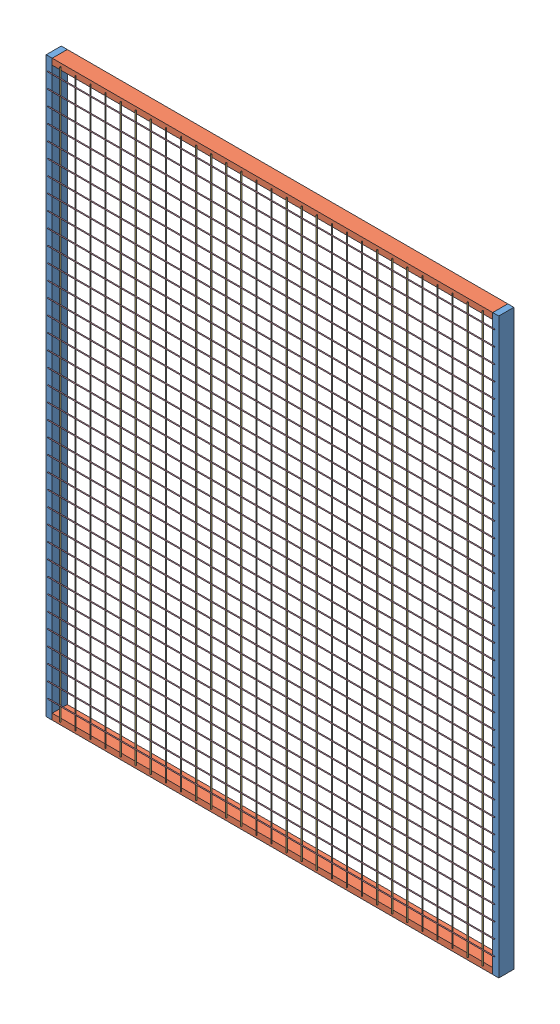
SolidWorks assembly 14E161 grilles protection 1900x1500.SLDASM, configuration Défaut (file format 10000). Lengths in mm.
Overall size (1500 1900 55.88).
70 component instances, 4 part files, 16 mates.
Components (placement in the parent):
- 14E026 profilé grillage 1900x50x20-1: 14E026 profilé grillage 1900x50x20.SLDPRT [Défaut] at (-634.6308 -991.4794 25) size (20 1900 50)
- 14E029 profilé grillage 1460x50x20-1: 14E029 profilé grillage 1460x50x20.SLDPRT [Défaut] at (-634.6308 888.5206 25) x (0 1 0) z (0 0 1) size (20 1460 50)
- 14E029 profilé grillage 1460x50x20-2: 14E029 profilé grillage 1460x50x20.SLDPRT [Défaut] at (-2094.6308 -971.4794 25) x (0 -1 0) z (0 0 1) size (20 1460 50)
- 14E026 profilé grillage 1900x50x20-2: 14E026 profilé grillage 1900x50x20.SLDPRT [Défaut] at (-2114.6308 -991.4794 25) size (20 1900 50)
- 14E031 fils vertical grille 1860 diam 3-51: 14E031 fils vertical grille 1860 diam 3.SLDPRT [Défaut] at (-2066.1308 -981.4794 26.5) x (-0.972525 0 0.232799) z (-0.232799 0 -0.972525) size (3 1880 3)
- 14E031 fils vertical grille 1860 diam 3-52: 14E031 fils vertical grille 1860 diam 3.SLDPRT [Défaut] at (-2016.1308 -981.4794 26.5) x (-0.972525 0 0.232799) z (-0.232799 0 -0.972525) size (3 1880 3)
- 14E031 fils vertical grille 1860 diam 3-53: 14E031 fils vertical grille 1860 diam 3.SLDPRT [Défaut] at (-1966.1308 -981.4794 26.5) x (-0.972525 0 0.232799) z (-0.232799 0 -0.972525) size (3 1880 3)
- 14E031 fils vertical grille 1860 diam 3-54: 14E031 fils vertical grille 1860 diam 3.SLDPRT [Défaut] at (-1916.1308 -981.4794 26.5) x (-0.972525 0 0.232799) z (-0.232799 0 -0.972525) size (3 1880 3)
- 14E031 fils vertical grille 1860 diam 3-55: 14E031 fils vertical grille 1860 diam 3.SLDPRT [Défaut] at (-1866.1308 -981.4794 26.5) x (-0.972525 0 0.232799) z (-0.232799 0 -0.972525) size (3 1880 3)
- 14E031 fils vertical grille 1860 diam 3-56: 14E031 fils vertical grille 1860 diam 3.SLDPRT [Défaut] at (-1816.1308 -981.4794 26.5) x (-0.972525 0 0.232799) z (-0.232799 0 -0.972525) size (3 1880 3)
- 14E031 fils vertical grille 1860 diam 3-57: 14E031 fils vertical grille 1860 diam 3.SLDPRT [Défaut] at (-1766.1308 -981.4794 26.5) x (-0.972525 0 0.232799) z (-0.232799 0 -0.972525) size (3 1880 3)
- 14E031 fils vertical grille 1860 diam 3-58: 14E031 fils vertical grille 1860 diam 3.SLDPRT [Défaut] at (-1716.1308 -981.4794 26.5) x (-0.972525 0 0.232799) z (-0.232799 0 -0.972525) size (3 1880 3)
- 14E031 fils vertical grille 1860 diam 3-59: 14E031 fils vertical grille 1860 diam 3.SLDPRT [Défaut] at (-1666.1308 -981.4794 26.5) x (-0.972525 0 0.232799) z (-0.232799 0 -0.972525) size (3 1880 3)
- 14E031 fils vertical grille 1860 diam 3-60: 14E031 fils vertical grille 1860 diam 3.SLDPRT [Défaut] at (-1616.1308 -981.4794 26.5) x (-0.972525 0 0.232799) z (-0.232799 0 -0.972525) size (3 1880 3)
- 14E031 fils vertical grille 1860 diam 3-61: 14E031 fils vertical grille 1860 diam 3.SLDPRT [Défaut] at (-1566.1308 -981.4794 26.5) x (-0.972525 0 0.232799) z (-0.232799 0 -0.972525) size (3 1880 3)
- 14E031 fils vertical grille 1860 diam 3-62: 14E031 fils vertical grille 1860 diam 3.SLDPRT [Défaut] at (-1516.1308 -981.4794 26.5) x (-0.972525 0 0.232799) z (-0.232799 0 -0.972525) size (3 1880 3)
- 14E031 fils vertical grille 1860 diam 3-63: 14E031 fils vertical grille 1860 diam 3.SLDPRT [Défaut] at (-1466.1308 -981.4794 26.5) x (-0.972525 0 0.232799) z (-0.232799 0 -0.972525) size (3 1880 3)
- 14E031 fils vertical grille 1860 diam 3-64: 14E031 fils vertical grille 1860 diam 3.SLDPRT [Défaut] at (-1416.1308 -981.4794 26.5) x (-0.972525 0 0.232799) z (-0.232799 0 -0.972525) size (3 1880 3)
- 14E031 fils vertical grille 1860 diam 3-65: 14E031 fils vertical grille 1860 diam 3.SLDPRT [Défaut] at (-1366.1308 -981.4794 26.5) x (-0.972525 0 0.232799) z (-0.232799 0 -0.972525) size (3 1880 3)
- 14E031 fils vertical grille 1860 diam 3-66: 14E031 fils vertical grille 1860 diam 3.SLDPRT [Défaut] at (-1316.1308 -981.4794 26.5) x (-0.972525 0 0.232799) z (-0.232799 0 -0.972525) size (3 1880 3)
- 14E031 fils vertical grille 1860 diam 3-67: 14E031 fils vertical grille 1860 diam 3.SLDPRT [Défaut] at (-1266.1308 -981.4794 26.5) x (-0.972525 0 0.232799) z (-0.232799 0 -0.972525) size (3 1880 3)
- 14E031 fils vertical grille 1860 diam 3-68: 14E031 fils vertical grille 1860 diam 3.SLDPRT [Défaut] at (-1216.1308 -981.4794 26.5) x (-0.972525 0 0.232799) z (-0.232799 0 -0.972525) size (3 1880 3)
- 14E031 fils vertical grille 1860 diam 3-69: 14E031 fils vertical grille 1860 diam 3.SLDPRT [Défaut] at (-1166.1308 -981.4794 26.5) x (-0.972525 0 0.232799) z (-0.232799 0 -0.972525) size (3 1880 3)
- 14E031 fils vertical grille 1860 diam 3-70: 14E031 fils vertical grille 1860 diam 3.SLDPRT [Défaut] at (-1116.1308 -981.4794 26.5) x (-0.972525 0 0.232799) z (-0.232799 0 -0.972525) size (3 1880 3)
- 14E031 fils vertical grille 1860 diam 3-71: 14E031 fils vertical grille 1860 diam 3.SLDPRT [Défaut] at (-1066.1308 -981.4794 26.5) x (-0.972525 0 0.232799) z (-0.232799 0 -0.972525) size (3 1880 3)
- 14E031 fils vertical grille 1860 diam 3-72: 14E031 fils vertical grille 1860 diam 3.SLDPRT [Défaut] at (-1016.1308 -981.4794 26.5) x (-0.972525 0 0.232799) z (-0.232799 0 -0.972525) size (3 1880 3)
- 14E031 fils vertical grille 1860 diam 3-73: 14E031 fils vertical grille 1860 diam 3.SLDPRT [Défaut] at (-966.1308 -981.4794 26.5) x (-0.972525 0 0.232799) z (-0.232799 0 -0.972525) size (3 1880 3)
- 14E031 fils vertical grille 1860 diam 3-74: 14E031 fils vertical grille 1860 diam 3.SLDPRT [Défaut] at (-916.1308 -981.4794 26.5) x (-0.972525 0 0.232799) z (-0.232799 0 -0.972525) size (3 1880 3)
- 14E031 fils vertical grille 1860 diam 3-75: 14E031 fils vertical grille 1860 diam 3.SLDPRT [Défaut] at (-866.1308 -981.4794 26.5) x (-0.972525 0 0.232799) z (-0.232799 0 -0.972525) size (3 1880 3)
- 14E031 fils vertical grille 1860 diam 3-76: 14E031 fils vertical grille 1860 diam 3.SLDPRT [Défaut] at (-816.1308 -981.4794 26.5) x (-0.972525 0 0.232799) z (-0.232799 0 -0.972525) size (3 1880 3)
- 14E031 fils vertical grille 1860 diam 3-77: 14E031 fils vertical grille 1860 diam 3.SLDPRT [Défaut] at (-766.1308 -981.4794 26.5) x (-0.972525 0 0.232799) z (-0.232799 0 -0.972525) size (3 1880 3)
- 14E031 fils vertical grille 1860 diam 3-78: 14E031 fils vertical grille 1860 diam 3.SLDPRT [Défaut] at (-716.1308 -981.4794 26.5) x (-0.972525 0 0.232799) z (-0.232799 0 -0.972525) size (3 1880 3)
- 14E031 fils vertical grille 1860 diam 3-79: 14E031 fils vertical grille 1860 diam 3.SLDPRT [Défaut] at (-666.1308 -981.4794 26.5) x (-0.972525 0 0.232799) z (-0.232799 0 -0.972525) size (3 1880 3)
- 14E032 fils horizontal grille 1480 diam 2.5-38: 14E032 fils horizontal grille 1480 diam 2.5.SLDPRT [Défaut] at (-2104.6308 867.2706 29.25) x (0 -0.92388 0.382683) z (0 0.382683 0.92388) size (2.5 1480 2.5)
- 14E032 fils horizontal grille 1480 diam 2.5-39: 14E032 fils horizontal grille 1480 diam 2.5.SLDPRT [Défaut] at (-2104.6308 817.2706 29.25) x (0 -0.92388 0.382683) z (0 0.382683 0.92388) size (2.5 1480 2.5)
- 14E032 fils horizontal grille 1480 diam 2.5-40: 14E032 fils horizontal grille 1480 diam 2.5.SLDPRT [Défaut] at (-2104.6308 767.2706 29.25) x (0 -0.92388 0.382683) z (0 0.382683 0.92388) size (2.5 1480 2.5)
- 14E032 fils horizontal grille 1480 diam 2.5-41: 14E032 fils horizontal grille 1480 diam 2.5.SLDPRT [Défaut] at (-2104.6308 717.2706 29.25) x (0 -0.92388 0.382683) z (0 0.382683 0.92388) size (2.5 1480 2.5)
- 14E032 fils horizontal grille 1480 diam 2.5-42: 14E032 fils horizontal grille 1480 diam 2.5.SLDPRT [Défaut] at (-2104.6308 667.2706 29.25) x (0 -0.92388 0.382683) z (0 0.382683 0.92388) size (2.5 1480 2.5)
- 14E032 fils horizontal grille 1480 diam 2.5-43: 14E032 fils horizontal grille 1480 diam 2.5.SLDPRT [Défaut] at (-2104.6308 617.2706 29.25) x (0 -0.92388 0.382683) z (0 0.382683 0.92388) size (2.5 1480 2.5)
- 14E032 fils horizontal grille 1480 diam 2.5-44: 14E032 fils horizontal grille 1480 diam 2.5.SLDPRT [Défaut] at (-2104.6308 567.2706 29.25) x (0 -0.92388 0.382683) z (0 0.382683 0.92388) size (2.5 1480 2.5)
- 14E032 fils horizontal grille 1480 diam 2.5-45: 14E032 fils horizontal grille 1480 diam 2.5.SLDPRT [Défaut] at (-2104.6308 517.2706 29.25) x (0 -0.92388 0.382683) z (0 0.382683 0.92388) size (2.5 1480 2.5)
- 14E032 fils horizontal grille 1480 diam 2.5-46: 14E032 fils horizontal grille 1480 diam 2.5.SLDPRT [Défaut] at (-2104.6308 467.2706 29.25) x (0 -0.92388 0.382683) z (0 0.382683 0.92388) size (2.5 1480 2.5)
- 14E032 fils horizontal grille 1480 diam 2.5-47: 14E032 fils horizontal grille 1480 diam 2.5.SLDPRT [Défaut] at (-2104.6308 417.2706 29.25) x (0 -0.92388 0.382683) z (0 0.382683 0.92388) size (2.5 1480 2.5)
- 14E032 fils horizontal grille 1480 diam 2.5-48: 14E032 fils horizontal grille 1480 diam 2.5.SLDPRT [Défaut] at (-2104.6308 367.2706 29.25) x (0 -0.92388 0.382683) z (0 0.382683 0.92388) size (2.5 1480 2.5)
- 14E032 fils horizontal grille 1480 diam 2.5-49: 14E032 fils horizontal grille 1480 diam 2.5.SLDPRT [Défaut] at (-2104.6308 317.2706 29.25) x (0 -0.92388 0.382683) z (0 0.382683 0.92388) size (2.5 1480 2.5)
- 14E032 fils horizontal grille 1480 diam 2.5-50: 14E032 fils horizontal grille 1480 diam 2.5.SLDPRT [Défaut] at (-2104.6308 267.2706 29.25) x (0 -0.92388 0.382683) z (0 0.382683 0.92388) size (2.5 1480 2.5)
- 14E032 fils horizontal grille 1480 diam 2.5-51: 14E032 fils horizontal grille 1480 diam 2.5.SLDPRT [Défaut] at (-2104.6308 217.2706 29.25) x (0 -0.92388 0.382683) z (0 0.382683 0.92388) size (2.5 1480 2.5)
- 14E032 fils horizontal grille 1480 diam 2.5-52: 14E032 fils horizontal grille 1480 diam 2.5.SLDPRT [Défaut] at (-2104.6308 167.2706 29.25) x (0 -0.92388 0.382683) z (0 0.382683 0.92388) size (2.5 1480 2.5)
- 14E032 fils horizontal grille 1480 diam 2.5-53: 14E032 fils horizontal grille 1480 diam 2.5.SLDPRT [Défaut] at (-2104.6308 117.2706 29.25) x (0 -0.92388 0.382683) z (0 0.382683 0.92388) size (2.5 1480 2.5)
- 14E032 fils horizontal grille 1480 diam 2.5-54: 14E032 fils horizontal grille 1480 diam 2.5.SLDPRT [Défaut] at (-2104.6308 67.2706 29.25) x (0 -0.92388 0.382683) z (0 0.382683 0.92388) size (2.5 1480 2.5)
- 14E032 fils horizontal grille 1480 diam 2.5-55: 14E032 fils horizontal grille 1480 diam 2.5.SLDPRT [Défaut] at (-2104.6308 17.2706 29.25) x (0 -0.92388 0.382683) z (0 0.382683 0.92388) size (2.5 1480 2.5)
- 14E032 fils horizontal grille 1480 diam 2.5-56: 14E032 fils horizontal grille 1480 diam 2.5.SLDPRT [Défaut] at (-2104.6308 -32.7294 29.25) x (0 -0.92388 0.382683) z (0 0.382683 0.92388) size (2.5 1480 2.5)
- 14E032 fils horizontal grille 1480 diam 2.5-57: 14E032 fils horizontal grille 1480 diam 2.5.SLDPRT [Défaut] at (-2104.6308 -82.7294 29.25) x (0 -0.92388 0.382683) z (0 0.382683 0.92388) size (2.5 1480 2.5)
- 14E032 fils horizontal grille 1480 diam 2.5-58: 14E032 fils horizontal grille 1480 diam 2.5.SLDPRT [Défaut] at (-2104.6308 -132.7294 29.25) x (0 -0.92388 0.382683) z (0 0.382683 0.92388) size (2.5 1480 2.5)
- 14E032 fils horizontal grille 1480 diam 2.5-59: 14E032 fils horizontal grille 1480 diam 2.5.SLDPRT [Défaut] at (-2104.6308 -182.7294 29.25) x (0 -0.92388 0.382683) z (0 0.382683 0.92388) size (2.5 1480 2.5)
- 14E032 fils horizontal grille 1480 diam 2.5-60: 14E032 fils horizontal grille 1480 diam 2.5.SLDPRT [Défaut] at (-2104.6308 -232.7294 29.25) x (0 -0.92388 0.382683) z (0 0.382683 0.92388) size (2.5 1480 2.5)
- 14E032 fils horizontal grille 1480 diam 2.5-61: 14E032 fils horizontal grille 1480 diam 2.5.SLDPRT [Défaut] at (-2104.6308 -282.7294 29.25) x (0 -0.92388 0.382683) z (0 0.382683 0.92388) size (2.5 1480 2.5)
- 14E032 fils horizontal grille 1480 diam 2.5-62: 14E032 fils horizontal grille 1480 diam 2.5.SLDPRT [Défaut] at (-2104.6308 -332.7294 29.25) x (0 -0.92388 0.382683) z (0 0.382683 0.92388) size (2.5 1480 2.5)
- 14E032 fils horizontal grille 1480 diam 2.5-63: 14E032 fils horizontal grille 1480 diam 2.5.SLDPRT [Défaut] at (-2104.6308 -382.7294 29.25) x (0 -0.92388 0.382683) z (0 0.382683 0.92388) size (2.5 1480 2.5)
- 14E032 fils horizontal grille 1480 diam 2.5-64: 14E032 fils horizontal grille 1480 diam 2.5.SLDPRT [Défaut] at (-2104.6308 -432.7294 29.25) x (0 -0.92388 0.382683) z (0 0.382683 0.92388) size (2.5 1480 2.5)
- 14E032 fils horizontal grille 1480 diam 2.5-65: 14E032 fils horizontal grille 1480 diam 2.5.SLDPRT [Défaut] at (-2104.6308 -482.7294 29.25) x (0 -0.92388 0.382683) z (0 0.382683 0.92388) size (2.5 1480 2.5)
- 14E032 fils horizontal grille 1480 diam 2.5-66: 14E032 fils horizontal grille 1480 diam 2.5.SLDPRT [Défaut] at (-2104.6308 -532.7294 29.25) x (0 -0.92388 0.382683) z (0 0.382683 0.92388) size (2.5 1480 2.5)
- 14E032 fils horizontal grille 1480 diam 2.5-67: 14E032 fils horizontal grille 1480 diam 2.5.SLDPRT [Défaut] at (-2104.6308 -582.7294 29.25) x (0 -0.92388 0.382683) z (0 0.382683 0.92388) size (2.5 1480 2.5)
- 14E032 fils horizontal grille 1480 diam 2.5-68: 14E032 fils horizontal grille 1480 diam 2.5.SLDPRT [Défaut] at (-2104.6308 -632.7294 29.25) x (0 -0.92388 0.382683) z (0 0.382683 0.92388) size (2.5 1480 2.5)
- 14E032 fils horizontal grille 1480 diam 2.5-69: 14E032 fils horizontal grille 1480 diam 2.5.SLDPRT [Défaut] at (-2104.6308 -682.7294 29.25) x (0 -0.92388 0.382683) z (0 0.382683 0.92388) size (2.5 1480 2.5)
- 14E032 fils horizontal grille 1480 diam 2.5-70: 14E032 fils horizontal grille 1480 diam 2.5.SLDPRT [Défaut] at (-2104.6308 -732.7294 29.25) x (0 -0.92388 0.382683) z (0 0.382683 0.92388) size (2.5 1480 2.5)
- 14E032 fils horizontal grille 1480 diam 2.5-71: 14E032 fils horizontal grille 1480 diam 2.5.SLDPRT [Défaut] at (-2104.6308 -782.7294 29.25) x (0 -0.92388 0.382683) z (0 0.382683 0.92388) size (2.5 1480 2.5)
- 14E032 fils horizontal grille 1480 diam 2.5-72: 14E032 fils horizontal grille 1480 diam 2.5.SLDPRT [Défaut] at (-2104.6308 -832.7294 29.25) x (0 -0.92388 0.382683) z (0 0.382683 0.92388) size (2.5 1480 2.5)
- 14E032 fils horizontal grille 1480 diam 2.5-73: 14E032 fils horizontal grille 1480 diam 2.5.SLDPRT [Défaut] at (-2104.6308 -882.7294 29.25) x (0 -0.92388 0.382683) z (0 0.382683 0.92388) size (2.5 1480 2.5)
- 14E032 fils horizontal grille 1480 diam 2.5-74: 14E032 fils horizontal grille 1480 diam 2.5.SLDPRT [Défaut] at (-2104.6308 -932.7294 29.25) x (0 -0.92388 0.382683) z (0 0.382683 0.92388) size (2.5 1480 2.5)
Mates (geometry in assembly coordinates):
- Coïncidente2: coincident anti-aligned: plane of 14E029 profilé grillage 1460x50x20-1 through (-2094.6308 888.5206 -25) normal (-1 0 0); plane of 14E026 profilé grillage 1900x50x20-2 through (-2094.6308 908.5206 25) normal (1 0 0)
- Coïncidente4: coincident anti-aligned: line of 14E029 profilé grillage 1460x50x20-1 through (-2094.6308 888.5206 25) axis (0 1 0); line of 14E026 profilé grillage 1900x50x20-2 through (-2094.6308 908.5206 25) axis (0 -1 0)
- Distance2: distance: line of 14E029 profilé grillage 1460x50x20-1 through (-2094.6308 908.5206 25) axis (0 0 -1); line of 14E026 profilé grillage 1900x50x20-2 through (-2094.6308 908.5206 25) axis (0 0 -1)
- Coïncidente6: coincident anti-aligned: plane of 14E026 profilé grillage 1900x50x20-1 through (-634.6308 908.5206 25) normal (-1 0 0); plane of 14E029 profilé grillage 1460x50x20-1 through (-634.6308 888.5206 -25) normal (1 0 0)
- Coïncidente7: coincident anti-aligned: line of 14E026 profilé grillage 1900x50x20-1 through (-634.6308 908.5206 25) axis (0 -1 0); line of 14E029 profilé grillage 1460x50x20-1 through (-634.6308 888.5206 25) axis (0 1 0)
- Distance3: distance: line of 14E026 profilé grillage 1900x50x20-1 through (-634.6308 908.5206 -25) axis (0 0 1); line of 14E029 profilé grillage 1460x50x20-1 through (-634.6308 908.5206 25) axis (0 0 -1)
- Coïncidente9: coincident anti-aligned: plane of 14E026 profilé grillage 1900x50x20-1 through (-634.6308 908.5206 25) normal (-1 0 0); plane of 14E029 profilé grillage 1460x50x20-2 through (-634.6308 -971.4794 -25) normal (1 0 0)
- Coïncidente10: coincident aligned: line of 14E026 profilé grillage 1900x50x20-1 through (-634.6308 908.5206 25) axis (0 -1 0); line of 14E029 profilé grillage 1460x50x20-2 through (-634.6308 -971.4794 25) axis (0 -1 0)
- Distance10: distance: line of 14E029 profilé grillage 1460x50x20-2 through (-634.6308 -991.4794 25) axis (0 0 -1); line of 14E026 profilé grillage 1900x50x20-1 through (-634.6308 -991.4794 -25) axis (0 0 1)
- Tangent1: tangent anti-aligned: plane of 14E029 profilé grillage 1460x50x20-1 through (-2094.6308 888.5206 25) normal (0 0 1); cylinder of 14E031 fils vertical grille 1860 diam 3-51 through (-2066.1308 898.5206 26.5) axis (0 -1 0) radius 1.5
- Distance5: distance = 10 mm aligned: plane of 14E029 profilé grillage 1460x50x20-1 through (-2094.6308 908.5206 25) normal (0 1 0); plane of 14E031 fils vertical grille 1860 diam 3-51 through (-2066.1308 898.5206 26.5) normal (0 1 0)
- Distance6: distance = 27 mm anti-aligned: plane of 14E026 profilé grillage 1900x50x20-2 through (-2094.6308 908.5206 25) normal (1 0 0); cylinder of 14E031 fils vertical grille 1860 diam 3-51 through (-2066.1308 898.5206 26.5) axis (0 -1 0) radius 1.5
- Parallèle1: parallel anti-aligned: line of 14E029 profilé grillage 1460x50x20-1 through (-2094.6308 888.5206 25) axis (1 0 0); cylinder of 14E032 fils horizontal grille 1480 diam 2.5-38 through (-624.6308 867.2706 29.25) axis (-1 0 0) radius 1.25
- Distance7: distance = 10 mm aligned: plane of 14E032 fils horizontal grille 1480 diam 2.5-38 through (-2104.6308 867.2706 29.25) normal (-1 0 0); plane of 14E026 profilé grillage 1900x50x20-2 through (-2114.6308 908.5206 25) normal (-1 0 0)
- Distance8: distance = 20 mm anti-aligned: cylinder of 14E032 fils horizontal grille 1480 diam 2.5-38 through (-624.6308 867.2706 29.25) axis (-1 0 0) radius 1.25; plane of 14E029 profilé grillage 1460x50x20-1 through (-2094.6308 888.5206 25) normal (0 -1 0)
- Distance9: distance = 3 mm anti-aligned: cylinder of 14E032 fils horizontal grille 1480 diam 2.5-38 through (-624.6308 867.2706 29.25) axis (-1 0 0) radius 1.25; plane of 14E029 profilé grillage 1460x50x20-1 through (-2094.6308 888.5206 25) normal (0 0 1)
